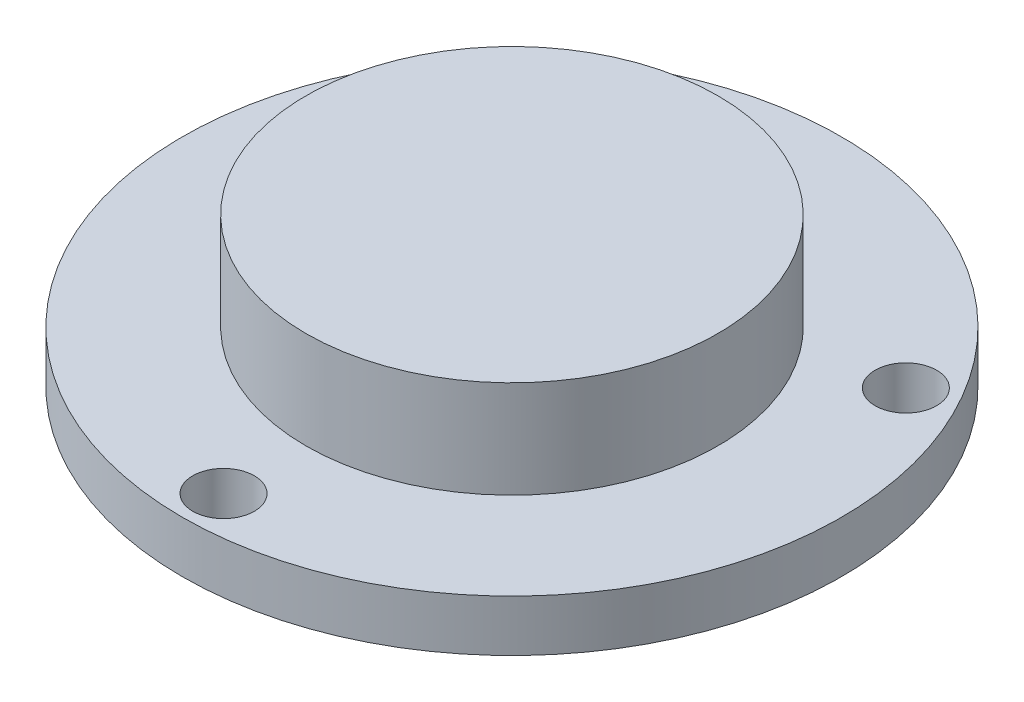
from build123d import *

# Parameters (mm, degrees)
SKETCH1_R             = 20.32
BOSS_EXTRUDE1_DEPTH   = 3.175
SKETCH2_R             = 12.7
BOSS_EXTRUDE2_DEPTH   = 6
F_6_CLEARANCE_HOLE1_D = 3.7973
CIRPATTERN1_COUNT     = 3


with BuildPart() as part:
    # Sketch1 → Boss-Extrude1 (new body)
    with BuildSketch(Plane(origin=(0, 0, 0), x_dir=(1, 0, 0), z_dir=(0, 1, 0))):
        with Locations(Location((0, 0, 0), (0, 0, 270))):
            Circle(SKETCH1_R)
    extrude(amount=BOSS_EXTRUDE1_DEPTH)

    # Sketch2 → Boss-Extrude2 (add)
    with BuildSketch(Plane(origin=(0, 3.175, 0), x_dir=(1, 0, 0), z_dir=(0, 1, 0))):
        with Locations(Location((0, 0, 0), (0, 0, 270))):
            Circle(SKETCH2_R)
    extrude(amount=BOSS_EXTRUDE2_DEPTH)

    # 6 Clearance Hole1 (through all)
    with Locations(Plane(origin=(0, 3.175, 0), x_dir=(1, 0, 0), z_dir=(0, 1, 0))):
        with Locations((0, -17.78)):
            f_6_clearance_hole1 = Hole(F_6_CLEARANCE_HOLE1_D / 2)

    # CirPattern1: 6 Clearance Hole1 ×3 about axis
    cirpattern1_axis = Axis((0, 0, 0), (0, 1, 0))
    for i in range(1, CIRPATTERN1_COUNT):
        add(f_6_clearance_hole1.rotate(cirpattern1_axis, i * 360 / CIRPATTERN1_COUNT), mode=Mode.SUBTRACT)


solid = part.part
